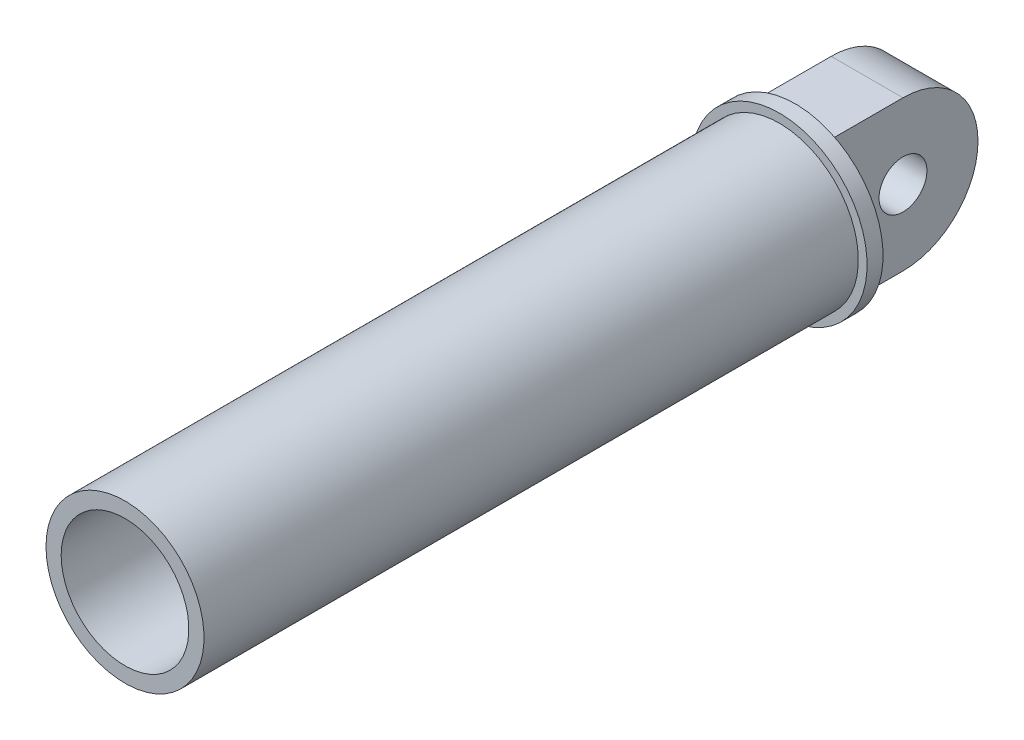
from build123d import *

# Parameters (mm, degrees)
SKETCH_1_R      = 49.5
SKETCH_1_R_2    = 40
EXTRUDE_1_DEPTH = 410
SKETCH_2_R      = 55
EXTRUDE_2_DEPTH = 10
SKETCH_3_R      = 40
EXTRUDE_3_DEPTH = 10
SKETCH_4_R      = 15
EXTRUDE_4_DEPTH = 22.5


with BuildPart() as part:
    # Sketch 1 → Extrude 1 (new body)
    with BuildSketch(Plane.XY):
        with Locations(Location((0, 0, 0), (0, 0, 180))):
            Circle(SKETCH_1_R)
        with Locations(Location((0, 0, 0), (0, 0, 180))):
            Circle(SKETCH_1_R_2, mode=Mode.SUBTRACT)
    extrude(amount=EXTRUDE_1_DEPTH)

    # Sketch 2 → Extrude 2 (add)
    with BuildSketch(Plane(origin=(0, 0, 0), x_dir=(-1, 0, 0), z_dir=(0, 0, -1))):
        Circle(SKETCH_2_R)
    extrude(amount=EXTRUDE_2_DEPTH)

    # Sketch 3 → Extrude 3 (add)
    with BuildSketch(Plane.XY):
        with Locations(Location((0, 0, 0), (0, 0, 180))):
            Circle(SKETCH_3_R)
    extrude(amount=EXTRUDE_3_DEPTH)

    # Sketch 4 → Extrude 4 (add, symmetric)
    with BuildSketch(Plane(origin=(0, 0, 0), x_dir=(0, 0, -1), z_dir=(1, 0, 0))):
        with BuildLine():
            Line((55, 47), (10, 47))
            Line((10, 47), (10, -47))
            Line((10, -47), (55, -47))
            ThreePointArc((55, -47), (102, 0), (55, 47))
        make_face()
        with Locations(Location((55, 0, 0), (0, 0, 180))):
            Circle(SKETCH_4_R, mode=Mode.SUBTRACT)
    extrude(amount=EXTRUDE_4_DEPTH, both=True)


solid = part.part
